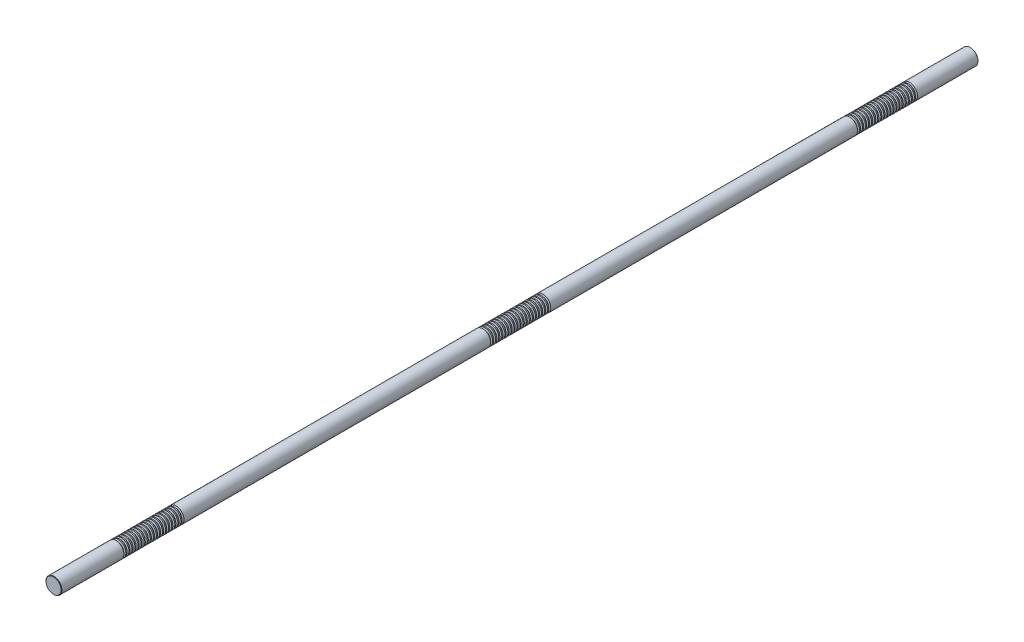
from build123d import *

# Parameters (mm, degrees)
SKETCH1_R           = 13
BOSS_EXTRUDE1_DEPTH = 750
CHAMFER1_SIZE       = 0.65
LPATTERN1_COUNT     = 20
LPATTERN1_PITCH     = 5
LPATTERN2_COUNT     = 3
LPATTERN2_PITCH     = 600


with BuildPart() as part:
    # Sketch1 → Boss-Extrude1 (new, symmetric)
    with BuildSketch(Plane.XY):
        Circle(SKETCH1_R)
    extrude(amount=BOSS_EXTRUDE1_DEPTH, both=True)

    # Chamfer1
    chamfer1_edges = [part.edges().sort_by_distance(p)[0] for p in [
        (-13, 0, -750),
        (-13, 0, 750),
    ]]
    chamfer(chamfer1_edges, length=CHAMFER1_SIZE)

    # Sketch2 → Cut-Revolve1 (revolve, cut)
    with BuildSketch(Plane(origin=(0, 0, 0), x_dir=(0, 0, -1), z_dir=(1, 0, 0)), mode=Mode.PRIVATE) as cut_revolve1_sk:
        Polygon((650.36843014, 13), (647.13156986, 13), (647.86843014, 10.25), (649.63156986, 10.25), align=None)
    cut_revolve1 = revolve(cut_revolve1_sk.sketch.rotate(Axis((0, 0, 750), (0, 0, -1)), 90), axis=Axis((0, 0, 750), (0, 0, -1)), mode=Mode.SUBTRACT)

    # LPattern1: Cut-Revolve1 ×20
    with Locations(*[(0, 0, i * LPATTERN1_PITCH) for i in range(1, LPATTERN1_COUNT)]):
        add(cut_revolve1, mode=Mode.SUBTRACT)

    # LPattern2: Cut-Revolve1 ×3
    with Locations(*[(0, 0, i * LPATTERN2_PITCH) for i in range(1, LPATTERN2_COUNT)]):
        add(cut_revolve1, mode=Mode.SUBTRACT)

    # LPattern2 copy 1 sketch → LPattern2 copy 1 (revolve, cut)
    with BuildSketch(Plane(origin=(0, 0, 605), x_dir=(0, 0, -1), z_dir=(1, 0, 0))):
        Polygon((650.36843014, 13), (647.13156986, 13), (647.86843014, 10.25), (649.63156986, 10.25), align=None)
    revolve(axis=Axis((0, 0, 1355), (0, 0, -1)), mode=Mode.SUBTRACT)

    # LPattern2 copy 2 sketch → LPattern2 copy 2 (revolve, cut)
    with BuildSketch(Plane(origin=(0, 0, 1205), x_dir=(0, 0, -1), z_dir=(1, 0, 0))):
        Polygon((650.36843014, 13), (647.13156986, 13), (647.86843014, 10.25), (649.63156986, 10.25), align=None)
    revolve(axis=Axis((0, 0, 1955), (0, 0, -1)), mode=Mode.SUBTRACT)

    # LPattern2 copy 3 sketch → LPattern2 copy 3 (revolve, cut)
    with BuildSketch(Plane(origin=(0, 0, 610), x_dir=(0, 0, -1), z_dir=(1, 0, 0))):
        Polygon((650.36843014, 13), (647.13156986, 13), (647.86843014, 10.25), (649.63156986, 10.25), align=None)
    revolve(axis=Axis((0, 0, 1360), (0, 0, -1)), mode=Mode.SUBTRACT)

    # LPattern2 copy 4 sketch → LPattern2 copy 4 (revolve, cut)
    with BuildSketch(Plane(origin=(0, 0, 1210), x_dir=(0, 0, -1), z_dir=(1, 0, 0))):
        Polygon((650.36843014, 13), (647.13156986, 13), (647.86843014, 10.25), (649.63156986, 10.25), align=None)
    revolve(axis=Axis((0, 0, 1960), (0, 0, -1)), mode=Mode.SUBTRACT)

    # LPattern2 copy 5 sketch → LPattern2 copy 5 (revolve, cut)
    with BuildSketch(Plane(origin=(0, 0, 615), x_dir=(0, 0, -1), z_dir=(1, 0, 0))):
        Polygon((650.36843014, 13), (647.13156986, 13), (647.86843014, 10.25), (649.63156986, 10.25), align=None)
    revolve(axis=Axis((0, 0, 1365), (0, 0, -1)), mode=Mode.SUBTRACT)

    # LPattern2 copy 6 sketch → LPattern2 copy 6 (revolve, cut)
    with BuildSketch(Plane(origin=(0, 0, 1215), x_dir=(0, 0, -1), z_dir=(1, 0, 0))):
        Polygon((650.36843014, 13), (647.13156986, 13), (647.86843014, 10.25), (649.63156986, 10.25), align=None)
    revolve(axis=Axis((0, 0, 1965), (0, 0, -1)), mode=Mode.SUBTRACT)

    # LPattern2 copy 7 sketch → LPattern2 copy 7 (revolve, cut)
    with BuildSketch(Plane(origin=(0, 0, 620), x_dir=(0, 0, -1), z_dir=(1, 0, 0))):
        Polygon((650.36843014, 13), (647.13156986, 13), (647.86843014, 10.25), (649.63156986, 10.25), align=None)
    revolve(axis=Axis((0, 0, 1370), (0, 0, -1)), mode=Mode.SUBTRACT)

    # LPattern2 copy 8 sketch → LPattern2 copy 8 (revolve, cut)
    with BuildSketch(Plane(origin=(0, 0, 1220), x_dir=(0, 0, -1), z_dir=(1, 0, 0))):
        Polygon((650.36843014, 13), (647.13156986, 13), (647.86843014, 10.25), (649.63156986, 10.25), align=None)
    revolve(axis=Axis((0, 0, 1970), (0, 0, -1)), mode=Mode.SUBTRACT)

    # LPattern2 copy 9 sketch → LPattern2 copy 9 (revolve, cut)
    with BuildSketch(Plane(origin=(0, 0, 625), x_dir=(0, 0, -1), z_dir=(1, 0, 0))):
        Polygon((650.36843014, 13), (647.13156986, 13), (647.86843014, 10.25), (649.63156986, 10.25), align=None)
    revolve(axis=Axis((0, 0, 1375), (0, 0, -1)), mode=Mode.SUBTRACT)

    # LPattern2 copy 10 sketch → LPattern2 copy 10 (revolve, cut)
    with BuildSketch(Plane(origin=(0, 0, 1225), x_dir=(0, 0, -1), z_dir=(1, 0, 0))):
        Polygon((650.36843014, 13), (647.13156986, 13), (647.86843014, 10.25), (649.63156986, 10.25), align=None)
    revolve(axis=Axis((0, 0, 1975), (0, 0, -1)), mode=Mode.SUBTRACT)

    # LPattern2 copy 11 sketch → LPattern2 copy 11 (revolve, cut)
    with BuildSketch(Plane(origin=(0, 0, 630), x_dir=(0, 0, -1), z_dir=(1, 0, 0))):
        Polygon((650.36843014, 13), (647.13156986, 13), (647.86843014, 10.25), (649.63156986, 10.25), align=None)
    revolve(axis=Axis((0, 0, 1380), (0, 0, -1)), mode=Mode.SUBTRACT)

    # LPattern2 copy 12 sketch → LPattern2 copy 12 (revolve, cut)
    with BuildSketch(Plane(origin=(0, 0, 1230), x_dir=(0, 0, -1), z_dir=(1, 0, 0))):
        Polygon((650.36843014, 13), (647.13156986, 13), (647.86843014, 10.25), (649.63156986, 10.25), align=None)
    revolve(axis=Axis((0, 0, 1980), (0, 0, -1)), mode=Mode.SUBTRACT)

    # LPattern2 copy 13 sketch → LPattern2 copy 13 (revolve, cut)
    with BuildSketch(Plane(origin=(0, 0, 635), x_dir=(0, 0, -1), z_dir=(1, 0, 0))):
        Polygon((650.36843014, 13), (647.13156986, 13), (647.86843014, 10.25), (649.63156986, 10.25), align=None)
    revolve(axis=Axis((0, 0, 1385), (0, 0, -1)), mode=Mode.SUBTRACT)

    # LPattern2 copy 14 sketch → LPattern2 copy 14 (revolve, cut)
    with BuildSketch(Plane(origin=(0, 0, 1235), x_dir=(0, 0, -1), z_dir=(1, 0, 0))):
        Polygon((650.36843014, 13), (647.13156986, 13), (647.86843014, 10.25), (649.63156986, 10.25), align=None)
    revolve(axis=Axis((0, 0, 1985), (0, 0, -1)), mode=Mode.SUBTRACT)

    # LPattern2 copy 15 sketch → LPattern2 copy 15 (revolve, cut)
    with BuildSketch(Plane(origin=(0, 0, 640), x_dir=(0, 0, -1), z_dir=(1, 0, 0))):
        Polygon((650.36843014, 13), (647.13156986, 13), (647.86843014, 10.25), (649.63156986, 10.25), align=None)
    revolve(axis=Axis((0, 0, 1390), (0, 0, -1)), mode=Mode.SUBTRACT)

    # LPattern2 copy 16 sketch → LPattern2 copy 16 (revolve, cut)
    with BuildSketch(Plane(origin=(0, 0, 1240), x_dir=(0, 0, -1), z_dir=(1, 0, 0))):
        Polygon((650.36843014, 13), (647.13156986, 13), (647.86843014, 10.25), (649.63156986, 10.25), align=None)
    revolve(axis=Axis((0, 0, 1990), (0, 0, -1)), mode=Mode.SUBTRACT)

    # LPattern2 copy 17 sketch → LPattern2 copy 17 (revolve, cut)
    with BuildSketch(Plane(origin=(0, 0, 645), x_dir=(0, 0, -1), z_dir=(1, 0, 0))):
        Polygon((650.36843014, 13), (647.13156986, 13), (647.86843014, 10.25), (649.63156986, 10.25), align=None)
    revolve(axis=Axis((0, 0, 1395), (0, 0, -1)), mode=Mode.SUBTRACT)

    # LPattern2 copy 18 sketch → LPattern2 copy 18 (revolve, cut)
    with BuildSketch(Plane(origin=(0, 0, 1245), x_dir=(0, 0, -1), z_dir=(1, 0, 0))):
        Polygon((650.36843014, 13), (647.13156986, 13), (647.86843014, 10.25), (649.63156986, 10.25), align=None)
    revolve(axis=Axis((0, 0, 1995), (0, 0, -1)), mode=Mode.SUBTRACT)

    # LPattern2 copy 19 sketch → LPattern2 copy 19 (revolve, cut)
    with BuildSketch(Plane(origin=(0, 0, 650), x_dir=(0, 0, -1), z_dir=(1, 0, 0))):
        Polygon((650.36843014, 13), (647.13156986, 13), (647.86843014, 10.25), (649.63156986, 10.25), align=None)
    revolve(axis=Axis((0, 0, 1400), (0, 0, -1)), mode=Mode.SUBTRACT)

    # LPattern2 copy 20 sketch → LPattern2 copy 20 (revolve, cut)
    with BuildSketch(Plane(origin=(0, 0, 1250), x_dir=(0, 0, -1), z_dir=(1, 0, 0))):
        Polygon((650.36843014, 13), (647.13156986, 13), (647.86843014, 10.25), (649.63156986, 10.25), align=None)
    revolve(axis=Axis((0, 0, 2000), (0, 0, -1)), mode=Mode.SUBTRACT)

    # LPattern2 copy 21 sketch → LPattern2 copy 21 (revolve, cut)
    with BuildSketch(Plane(origin=(0, 0, 655), x_dir=(0, 0, -1), z_dir=(1, 0, 0))):
        Polygon((650.36843014, 13), (647.13156986, 13), (647.86843014, 10.25), (649.63156986, 10.25), align=None)
    revolve(axis=Axis((0, 0, 1405), (0, 0, -1)), mode=Mode.SUBTRACT)

    # LPattern2 copy 22 sketch → LPattern2 copy 22 (revolve, cut)
    with BuildSketch(Plane(origin=(0, 0, 1255), x_dir=(0, 0, -1), z_dir=(1, 0, 0))):
        Polygon((650.36843014, 13), (647.13156986, 13), (647.86843014, 10.25), (649.63156986, 10.25), align=None)
    revolve(axis=Axis((0, 0, 2005), (0, 0, -1)), mode=Mode.SUBTRACT)

    # LPattern2 copy 23 sketch → LPattern2 copy 23 (revolve, cut)
    with BuildSketch(Plane(origin=(0, 0, 660), x_dir=(0, 0, -1), z_dir=(1, 0, 0))):
        Polygon((650.36843014, 13), (647.13156986, 13), (647.86843014, 10.25), (649.63156986, 10.25), align=None)
    revolve(axis=Axis((0, 0, 1410), (0, 0, -1)), mode=Mode.SUBTRACT)

    # LPattern2 copy 24 sketch → LPattern2 copy 24 (revolve, cut)
    with BuildSketch(Plane(origin=(0, 0, 1260), x_dir=(0, 0, -1), z_dir=(1, 0, 0))):
        Polygon((650.36843014, 13), (647.13156986, 13), (647.86843014, 10.25), (649.63156986, 10.25), align=None)
    revolve(axis=Axis((0, 0, 2010), (0, 0, -1)), mode=Mode.SUBTRACT)

    # LPattern2 copy 25 sketch → LPattern2 copy 25 (revolve, cut)
    with BuildSketch(Plane(origin=(0, 0, 665), x_dir=(0, 0, -1), z_dir=(1, 0, 0))):
        Polygon((650.36843014, 13), (647.13156986, 13), (647.86843014, 10.25), (649.63156986, 10.25), align=None)
    revolve(axis=Axis((0, 0, 1415), (0, 0, -1)), mode=Mode.SUBTRACT)

    # LPattern2 copy 26 sketch → LPattern2 copy 26 (revolve, cut)
    with BuildSketch(Plane(origin=(0, 0, 1265), x_dir=(0, 0, -1), z_dir=(1, 0, 0))):
        Polygon((650.36843014, 13), (647.13156986, 13), (647.86843014, 10.25), (649.63156986, 10.25), align=None)
    revolve(axis=Axis((0, 0, 2015), (0, 0, -1)), mode=Mode.SUBTRACT)

    # LPattern2 copy 27 sketch → LPattern2 copy 27 (revolve, cut)
    with BuildSketch(Plane(origin=(0, 0, 670), x_dir=(0, 0, -1), z_dir=(1, 0, 0))):
        Polygon((650.36843014, 13), (647.13156986, 13), (647.86843014, 10.25), (649.63156986, 10.25), align=None)
    revolve(axis=Axis((0, 0, 1420), (0, 0, -1)), mode=Mode.SUBTRACT)

    # LPattern2 copy 28 sketch → LPattern2 copy 28 (revolve, cut)
    with BuildSketch(Plane(origin=(0, 0, 1270), x_dir=(0, 0, -1), z_dir=(1, 0, 0))):
        Polygon((650.36843014, 13), (647.13156986, 13), (647.86843014, 10.25), (649.63156986, 10.25), align=None)
    revolve(axis=Axis((0, 0, 2020), (0, 0, -1)), mode=Mode.SUBTRACT)

    # LPattern2 copy 29 sketch → LPattern2 copy 29 (revolve, cut)
    with BuildSketch(Plane(origin=(0, 0, 675), x_dir=(0, 0, -1), z_dir=(1, 0, 0))):
        Polygon((650.36843014, 13), (647.13156986, 13), (647.86843014, 10.25), (649.63156986, 10.25), align=None)
    revolve(axis=Axis((0, 0, 1425), (0, 0, -1)), mode=Mode.SUBTRACT)

    # LPattern2 copy 30 sketch → LPattern2 copy 30 (revolve, cut)
    with BuildSketch(Plane(origin=(0, 0, 1275), x_dir=(0, 0, -1), z_dir=(1, 0, 0))):
        Polygon((650.36843014, 13), (647.13156986, 13), (647.86843014, 10.25), (649.63156986, 10.25), align=None)
    revolve(axis=Axis((0, 0, 2025), (0, 0, -1)), mode=Mode.SUBTRACT)

    # LPattern2 copy 31 sketch → LPattern2 copy 31 (revolve, cut)
    with BuildSketch(Plane(origin=(0, 0, 680), x_dir=(0, 0, -1), z_dir=(1, 0, 0))):
        Polygon((650.36843014, 13), (647.13156986, 13), (647.86843014, 10.25), (649.63156986, 10.25), align=None)
    revolve(axis=Axis((0, 0, 1430), (0, 0, -1)), mode=Mode.SUBTRACT)

    # LPattern2 copy 32 sketch → LPattern2 copy 32 (revolve, cut)
    with BuildSketch(Plane(origin=(0, 0, 1280), x_dir=(0, 0, -1), z_dir=(1, 0, 0))):
        Polygon((650.36843014, 13), (647.13156986, 13), (647.86843014, 10.25), (649.63156986, 10.25), align=None)
    revolve(axis=Axis((0, 0, 2030), (0, 0, -1)), mode=Mode.SUBTRACT)

    # LPattern2 copy 33 sketch → LPattern2 copy 33 (revolve, cut)
    with BuildSketch(Plane(origin=(0, 0, 685), x_dir=(0, 0, -1), z_dir=(1, 0, 0))):
        Polygon((650.36843014, 13), (647.13156986, 13), (647.86843014, 10.25), (649.63156986, 10.25), align=None)
    revolve(axis=Axis((0, 0, 1435), (0, 0, -1)), mode=Mode.SUBTRACT)

    # LPattern2 copy 34 sketch → LPattern2 copy 34 (revolve, cut)
    with BuildSketch(Plane(origin=(0, 0, 1285), x_dir=(0, 0, -1), z_dir=(1, 0, 0))):
        Polygon((650.36843014, 13), (647.13156986, 13), (647.86843014, 10.25), (649.63156986, 10.25), align=None)
    revolve(axis=Axis((0, 0, 2035), (0, 0, -1)), mode=Mode.SUBTRACT)

    # LPattern2 copy 35 sketch → LPattern2 copy 35 (revolve, cut)
    with BuildSketch(Plane(origin=(0, 0, 690), x_dir=(0, 0, -1), z_dir=(1, 0, 0))):
        Polygon((650.36843014, 13), (647.13156986, 13), (647.86843014, 10.25), (649.63156986, 10.25), align=None)
    revolve(axis=Axis((0, 0, 1440), (0, 0, -1)), mode=Mode.SUBTRACT)

    # LPattern2 copy 36 sketch → LPattern2 copy 36 (revolve, cut)
    with BuildSketch(Plane(origin=(0, 0, 1290), x_dir=(0, 0, -1), z_dir=(1, 0, 0))):
        Polygon((650.36843014, 13), (647.13156986, 13), (647.86843014, 10.25), (649.63156986, 10.25), align=None)
    revolve(axis=Axis((0, 0, 2040), (0, 0, -1)), mode=Mode.SUBTRACT)

    # LPattern2 copy 37 sketch → LPattern2 copy 37 (revolve, cut)
    with BuildSketch(Plane(origin=(0, 0, 695), x_dir=(0, 0, -1), z_dir=(1, 0, 0))):
        Polygon((650.36843014, 13), (647.13156986, 13), (647.86843014, 10.25), (649.63156986, 10.25), align=None)
    revolve(axis=Axis((0, 0, 1445), (0, 0, -1)), mode=Mode.SUBTRACT)

    # LPattern2 copy 38 sketch → LPattern2 copy 38 (revolve, cut)
    with BuildSketch(Plane(origin=(0, 0, 1295), x_dir=(0, 0, -1), z_dir=(1, 0, 0))):
        Polygon((650.36843014, 13), (647.13156986, 13), (647.86843014, 10.25), (649.63156986, 10.25), align=None)
    revolve(axis=Axis((0, 0, 2045), (0, 0, -1)), mode=Mode.SUBTRACT)


solid = part.part
